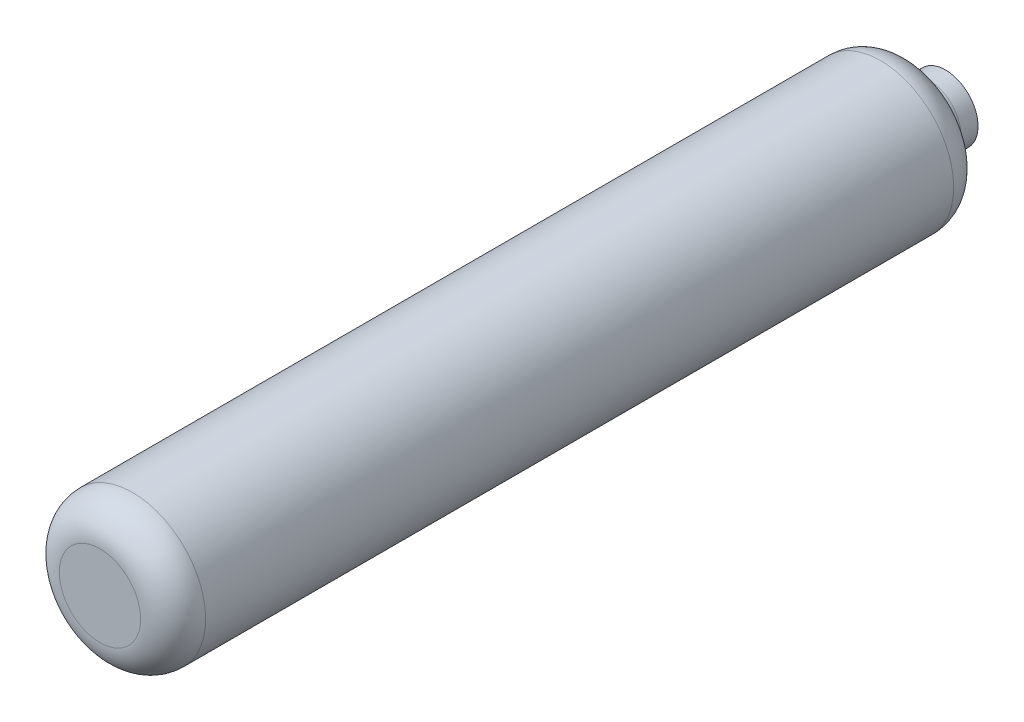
ISO-10303-21;
HEADER;
FILE_DESCRIPTION(('STEP AP214'),'2;1');
FILE_NAME('part.step','',(''),(''),'','','');
FILE_SCHEMA(('AUTOMOTIVE_DESIGN { 1 0 10303 214 1 1 1 1 }'));
ENDSEC;
DATA;
#1=APPLICATION_CONTEXT('core data for automotive mechanical design processes');
#2=APPLICATION_PROTOCOL_DEFINITION('international standard','automotive_design',2000,#1);
#3=PRODUCT_CONTEXT('',#1,'mechanical');
#4=PRODUCT('Part','Part','',(#3));
#5=PRODUCT_RELATED_PRODUCT_CATEGORY('part','',(#4));
#6=PRODUCT_DEFINITION_FORMATION('','',#4);
#7=PRODUCT_DEFINITION_CONTEXT('part definition',#1,'design');
#8=PRODUCT_DEFINITION('design','',#6,#7);
#9=PRODUCT_DEFINITION_SHAPE('','',#8);
#10=(LENGTH_UNIT() NAMED_UNIT(*) SI_UNIT(.MILLI.,.METRE.));
#11=(NAMED_UNIT(*) PLANE_ANGLE_UNIT() SI_UNIT($,.RADIAN.));
#12=(NAMED_UNIT(*) SI_UNIT($,.STERADIAN.) SOLID_ANGLE_UNIT());
#13=UNCERTAINTY_MEASURE_WITH_UNIT(LENGTH_MEASURE(1.E-05),#10,'distance_accuracy_value','');
#14=(GEOMETRIC_REPRESENTATION_CONTEXT(3) GLOBAL_UNCERTAINTY_ASSIGNED_CONTEXT((#13)) GLOBAL_UNIT_ASSIGNED_CONTEXT((#10,
#11,#12)) REPRESENTATION_CONTEXT('',''));
#15=CARTESIAN_POINT('',(0.,0.,0.));
#16=DIRECTION('',(0.,0.,1.));
#17=DIRECTION('',(1.,0.,0.));
#18=AXIS2_PLACEMENT_3D('',#15,#16,#17);
#19=CARTESIAN_POINT('',(0.,0.,1371.11666910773));
#20=DIRECTION('',(0.,0.,-1.));
#21=DIRECTION('',(-1.,0.,0.));
#22=AXIS2_PLACEMENT_3D('',#19,#20,#21);
#23=CYLINDRICAL_SURFACE('',#22,23.625);
#24=CARTESIAN_POINT('',(0.,0.,1360.61666910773));
#25=DIRECTION('',(0.,0.,1.));
#26=DIRECTION('',(1.,0.,0.));
#27=AXIS2_PLACEMENT_3D('',#24,#25,#26);
#28=CIRCLE('',#27,23.625);
#29=CARTESIAN_POINT('',(23.625,0.,1360.61666910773));
#30=VERTEX_POINT('',#29);
#31=EDGE_CURVE('E56',#30,#30,#28,.F.);
#32=ORIENTED_EDGE('',*,*,#31,.T.);
#33=EDGE_LOOP('',(#32));
#34=FACE_BOUND('',#33,.T.);
#35=CARTESIAN_POINT('',(0.,0.,1119.11666910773));
#36=DIRECTION('',(0.,0.,1.));
#37=DIRECTION('',(1.,0.,0.));
#38=AXIS2_PLACEMENT_3D('',#35,#36,#37);
#39=CIRCLE('',#38,23.625);
#40=CARTESIAN_POINT('',(23.625,0.,1119.11666910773));
#41=VERTEX_POINT('',#40);
#42=EDGE_CURVE('E61',#41,#41,#39,.T.);
#43=ORIENTED_EDGE('',*,*,#42,.T.);
#44=EDGE_LOOP('',(#43));
#45=FACE_BOUND('',#44,.T.);
#46=ADVANCED_FACE('F43',(#34,#45),#23,.T.);
#47=CARTESIAN_POINT('',(0.,0.,1371.11666910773));
#48=DIRECTION('',(0.,0.,1.));
#49=DIRECTION('',(1.,0.,0.));
#50=AXIS2_PLACEMENT_3D('',#47,#48,#49);
#51=PLANE('',#50);
#52=CARTESIAN_POINT('',(0.,0.,1371.11666910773));
#53=DIRECTION('',(0.,0.,1.));
#54=DIRECTION('',(1.,0.,0.));
#55=AXIS2_PLACEMENT_3D('',#52,#53,#54);
#56=CIRCLE('',#55,13.125);
#57=CARTESIAN_POINT('',(13.125,0.,1371.11666910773));
#58=VERTEX_POINT('',#57);
#59=EDGE_CURVE('E67',#58,#58,#56,.T.);
#60=ORIENTED_EDGE('',*,*,#59,.T.);
#61=EDGE_LOOP('',(#60));
#62=FACE_BOUND('',#61,.T.);
#63=ADVANCED_FACE('F90',(#62),#51,.T.);
#64=CARTESIAN_POINT('',(0.,0.,1360.61666910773));
#65=DIRECTION('',(0.,0.,1.));
#66=DIRECTION('',(1.,0.,0.));
#67=AXIS2_PLACEMENT_3D('',#64,#65,#66);
#68=TOROIDAL_SURFACE('',#67,13.125,10.5);
#69=ORIENTED_EDGE('',*,*,#31,.F.);
#70=EDGE_LOOP('',(#69));
#71=FACE_BOUND('',#70,.T.);
#72=ORIENTED_EDGE('',*,*,#59,.F.);
#73=EDGE_LOOP('',(#72));
#74=FACE_BOUND('',#73,.T.);
#75=ADVANCED_FACE('F87',(#71,#74),#68,.T.);
#76=CARTESIAN_POINT('',(0.,0.,1119.11666910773));
#77=DIRECTION('',(0.,0.,1.));
#78=DIRECTION('',(1.,0.,0.));
#79=AXIS2_PLACEMENT_3D('',#76,#77,#78);
#80=TOROIDAL_SURFACE('',#79,13.125,10.5);
#81=CARTESIAN_POINT('',(0.,0.,1108.7635294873));
#82=DIRECTION('',(0.,0.,1.));
#83=DIRECTION('',(1.,0.,0.));
#84=AXIS2_PLACEMENT_3D('',#81,#82,#83);
#85=CIRCLE('',#84,14.875);
#86=CARTESIAN_POINT('',(14.875,0.,1108.7635294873));
#87=VERTEX_POINT('',#86);
#88=EDGE_CURVE('E10',#87,#87,#85,.T.);
#89=ORIENTED_EDGE('',*,*,#88,.T.);
#90=EDGE_LOOP('',(#89));
#91=FACE_BOUND('',#90,.T.);
#92=ORIENTED_EDGE('',*,*,#42,.F.);
#93=EDGE_LOOP('',(#92));
#94=FACE_BOUND('',#93,.T.);
#95=ADVANCED_FACE('F80',(#91,#94),#80,.T.);
#96=CARTESIAN_POINT('',(0.,0.,1098.11666910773));
#97=DIRECTION('',(0.,0.,1.));
#98=DIRECTION('',(1.,0.,0.));
#99=AXIS2_PLACEMENT_3D('',#96,#97,#98);
#100=CYLINDRICAL_SURFACE('',#99,10.5);
#101=CARTESIAN_POINT('',(0.,0.,1103.58695967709));
#102=DIRECTION('',(0.,0.,-1.));
#103=DIRECTION('',(-1.,0.,0.));
#104=AXIS2_PLACEMENT_3D('',#101,#102,#103);
#105=CIRCLE('',#104,10.5);
#106=CARTESIAN_POINT('',(-10.5,0.,1103.58695967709));
#107=VERTEX_POINT('',#106);
#108=EDGE_CURVE('E51',#107,#107,#105,.T.);
#109=ORIENTED_EDGE('',*,*,#108,.T.);
#110=EDGE_LOOP('',(#109));
#111=FACE_BOUND('',#110,.T.);
#112=CARTESIAN_POINT('',(0.,0.,1098.11666910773));
#113=DIRECTION('',(0.,0.,-1.));
#114=DIRECTION('',(-1.,0.,0.));
#115=AXIS2_PLACEMENT_3D('',#112,#113,#114);
#116=CIRCLE('',#115,10.5);
#117=CARTESIAN_POINT('',(-10.5,0.,1098.11666910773));
#118=VERTEX_POINT('',#117);
#119=EDGE_CURVE('E71',#118,#118,#116,.T.);
#120=ORIENTED_EDGE('',*,*,#119,.F.);
#121=EDGE_LOOP('',(#120));
#122=FACE_BOUND('',#121,.T.);
#123=ADVANCED_FACE('F78',(#111,#122),#100,.T.);
#124=CARTESIAN_POINT('',(0.,0.,1098.11666910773));
#125=DIRECTION('',(0.,0.,-1.));
#126=DIRECTION('',(-1.,0.,0.));
#127=AXIS2_PLACEMENT_3D('',#124,#125,#126);
#128=PLANE('',#127);
#129=ORIENTED_EDGE('',*,*,#119,.T.);
#130=EDGE_LOOP('',(#129));
#131=FACE_BOUND('',#130,.T.);
#132=ADVANCED_FACE('F76',(#131),#128,.T.);
#133=CARTESIAN_POINT('',(0.,0.,1103.58695967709));
#134=DIRECTION('',(0.,0.,-1.));
#135=DIRECTION('',(-1.,0.,0.));
#136=AXIS2_PLACEMENT_3D('',#133,#134,#135);
#137=TOROIDAL_SURFACE('',#136,15.75,5.25);
#138=ORIENTED_EDGE('',*,*,#88,.F.);
#139=EDGE_LOOP('',(#138));
#140=FACE_BOUND('',#139,.T.);
#141=ORIENTED_EDGE('',*,*,#108,.F.);
#142=EDGE_LOOP('',(#141));
#143=FACE_BOUND('',#142,.T.);
#144=ADVANCED_FACE('F45',(#140,#143),#137,.F.);
#145=CLOSED_SHELL('',(#46,#63,#75,#95,#123,#132,#144));
#146=MANIFOLD_SOLID_BREP('B2',#145);
#147=ADVANCED_BREP_SHAPE_REPRESENTATION('',(#18,#146),#14);
#148=SHAPE_DEFINITION_REPRESENTATION(#9,#147);
ENDSEC;
END-ISO-10303-21;
